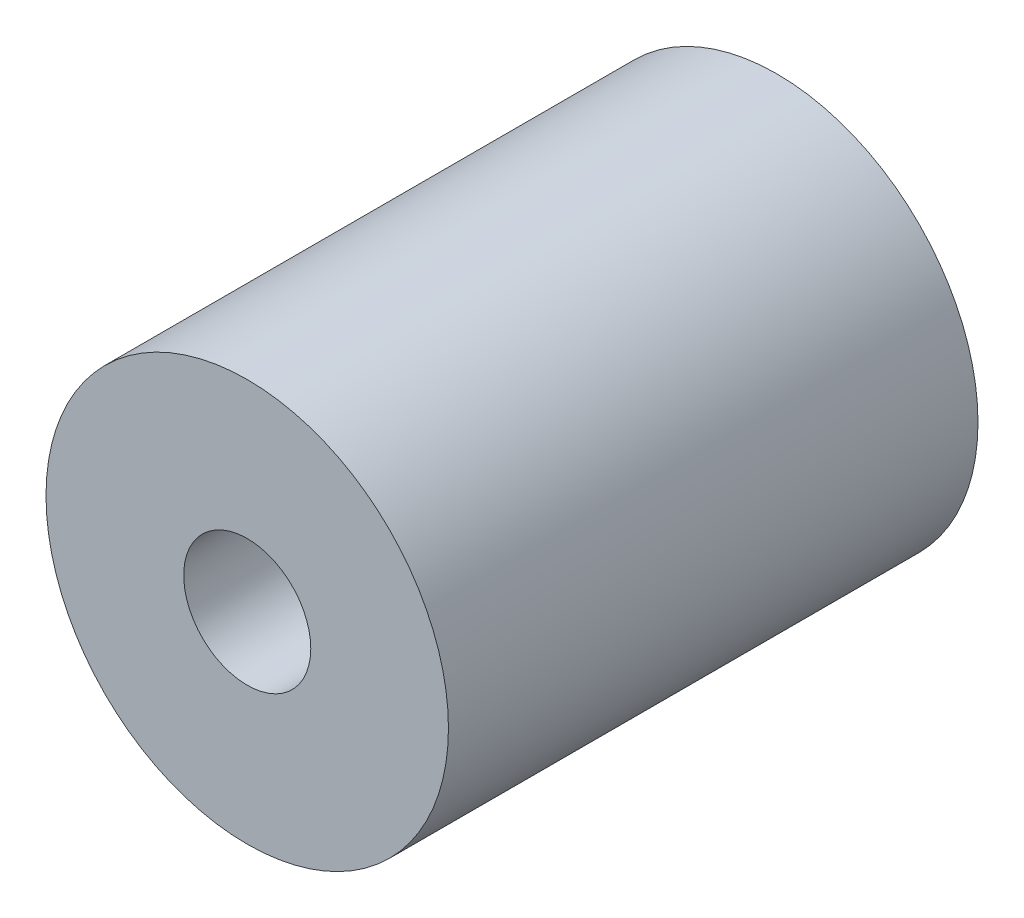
from build123d import *

# Parameters (mm, degrees)
ESQUISSE1_R        = 9.5
ESQUISSE1_R_2      = 3
BOSS_EXTRU_1_DEPTH = 25


with BuildPart() as part:
    # Esquisse1 → Boss.-Extru.1 (new body)
    with BuildSketch(Plane.XY):
        Circle(ESQUISSE1_R)
        Circle(ESQUISSE1_R_2, mode=Mode.SUBTRACT)
    extrude(amount=BOSS_EXTRU_1_DEPTH)


solid = part.part
